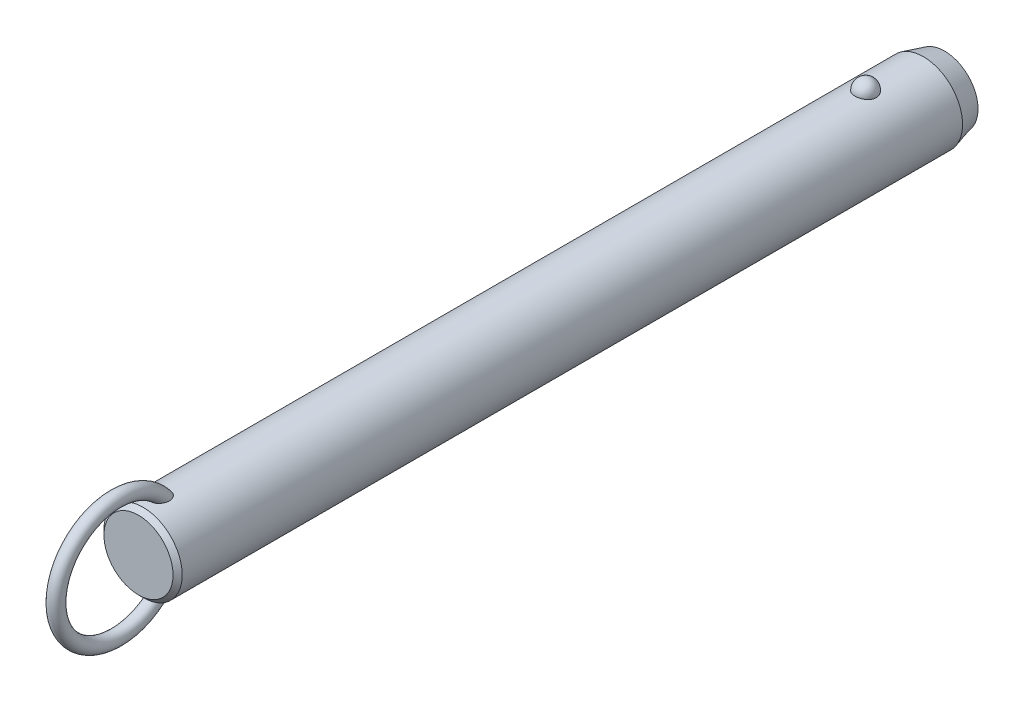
ISO-10303-21;
HEADER;
FILE_DESCRIPTION(('STEP AP214'),'2;1');
FILE_NAME('part.step','',(''),(''),'','','');
FILE_SCHEMA(('AUTOMOTIVE_DESIGN { 1 0 10303 214 1 1 1 1 }'));
ENDSEC;
DATA;
#1=APPLICATION_CONTEXT('core data for automotive mechanical design processes');
#2=APPLICATION_PROTOCOL_DEFINITION('international standard','automotive_design',2000,#1);
#3=PRODUCT_CONTEXT('',#1,'mechanical');
#4=PRODUCT('Part','Part','',(#3));
#5=PRODUCT_RELATED_PRODUCT_CATEGORY('part','',(#4));
#6=PRODUCT_DEFINITION_FORMATION('','',#4);
#7=PRODUCT_DEFINITION_CONTEXT('part definition',#1,'design');
#8=PRODUCT_DEFINITION('design','',#6,#7);
#9=PRODUCT_DEFINITION_SHAPE('','',#8);
#10=(LENGTH_UNIT() NAMED_UNIT(*) SI_UNIT(.MILLI.,.METRE.));
#11=(NAMED_UNIT(*) PLANE_ANGLE_UNIT() SI_UNIT($,.RADIAN.));
#12=(NAMED_UNIT(*) SI_UNIT($,.STERADIAN.) SOLID_ANGLE_UNIT());
#13=UNCERTAINTY_MEASURE_WITH_UNIT(LENGTH_MEASURE(1.E-05),#10,'distance_accuracy_value','');
#14=(GEOMETRIC_REPRESENTATION_CONTEXT(3) GLOBAL_UNCERTAINTY_ASSIGNED_CONTEXT((#13)) GLOBAL_UNIT_ASSIGNED_CONTEXT((#10,
#11,#12)) REPRESENTATION_CONTEXT('',''));
#15=CARTESIAN_POINT('',(0.,0.,0.));
#16=DIRECTION('',(0.,0.,1.));
#17=DIRECTION('',(1.,0.,0.));
#18=AXIS2_PLACEMENT_3D('',#15,#16,#17);
#19=CARTESIAN_POINT('',(0.,0.,190.5));
#20=DIRECTION('',(0.,0.,-1.));
#21=DIRECTION('',(-1.,0.,0.));
#22=AXIS2_PLACEMENT_3D('',#19,#20,#21);
#23=CYLINDRICAL_SURFACE('',#22,11.1);
#24=CARTESIAN_POINT('',(2.9724815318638,10.6945945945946,-3.00000000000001));
#25=CARTESIAN_POINT('',(2.97247830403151,10.6945972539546,-2.8322505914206));
#26=CARTESIAN_POINT('',(2.95876598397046,10.6984356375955,-2.66445972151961));
#27=CARTESIAN_POINT('',(2.90424529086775,10.7133624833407,-2.3336238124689));
#28=CARTESIAN_POINT('',(2.8634252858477,10.7244540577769,-2.17058084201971));
#29=CARTESIAN_POINT('',(2.75573657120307,10.7526272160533,-1.85396767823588));
#30=CARTESIAN_POINT('',(2.68887937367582,10.7697061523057,-1.70039333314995));
#31=CARTESIAN_POINT('',(2.53079696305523,10.8079438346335,-1.4069159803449));
#32=CARTESIAN_POINT('',(2.43957264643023,10.8291024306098,-1.26701246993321));
#33=CARTESIAN_POINT('',(2.23458150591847,10.8732541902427,-1.00409565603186));
#34=CARTESIAN_POINT('',(2.12071295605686,10.8962553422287,-0.881162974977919));
#35=CARTESIAN_POINT('',(1.87365402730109,10.9414421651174,-0.656352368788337));
#36=CARTESIAN_POINT('',(1.74046358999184,10.9636278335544,-0.554474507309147));
#37=CARTESIAN_POINT('',(1.45872188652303,11.0046495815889,-0.374872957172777));
#38=CARTESIAN_POINT('',(1.31021276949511,11.0234944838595,-0.297085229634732));
#39=CARTESIAN_POINT('',(1.00170030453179,11.0557957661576,-0.167529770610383));
#40=CARTESIAN_POINT('',(0.841698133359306,11.0692526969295,-0.1157593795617));
#41=CARTESIAN_POINT('',(0.517607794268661,11.0890932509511,-0.0403925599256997));
#42=CARTESIAN_POINT('',(0.353633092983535,11.0955916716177,-0.0163383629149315));
#43=CARTESIAN_POINT('',(0.0238420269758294,11.1011989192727,0.00445177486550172));
#44=CARTESIAN_POINT('',(-0.141974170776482,11.1003084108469,0.00119017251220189));
#45=CARTESIAN_POINT('',(-0.468405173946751,11.0912990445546,-0.0323233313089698));
#46=CARTESIAN_POINT('',(-0.629059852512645,11.0832767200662,-0.062214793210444));
#47=CARTESIAN_POINT('',(-0.942937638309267,11.0609962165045,-0.147645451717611));
#48=CARTESIAN_POINT('',(-1.09616062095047,11.0467379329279,-0.203185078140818));
#49=CARTESIAN_POINT('',(-1.39181061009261,11.0134071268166,-0.338752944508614));
#50=CARTESIAN_POINT('',(-1.53417383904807,10.9943086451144,-0.418913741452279));
#51=CARTESIAN_POINT('',(-1.80342160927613,10.9533667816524,-0.601448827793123));
#52=CARTESIAN_POINT('',(-1.9303046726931,10.9315231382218,-0.703825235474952));
#53=CARTESIAN_POINT('',(-2.16747598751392,10.887005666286,-0.930091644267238));
#54=CARTESIAN_POINT('',(-2.27742774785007,10.8643239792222,-1.05433291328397));
#55=CARTESIAN_POINT('',(-2.47517316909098,10.8209886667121,-1.31966633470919));
#56=CARTESIAN_POINT('',(-2.56296538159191,10.8003351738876,-1.46075958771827));
#57=CARTESIAN_POINT('',(-2.71500300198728,10.7631304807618,-1.75753646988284));
#58=CARTESIAN_POINT('',(-2.77898901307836,10.7466250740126,-1.91335887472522));
#59=CARTESIAN_POINT('',(-2.88046189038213,10.7198747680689,-2.23391529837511));
#60=CARTESIAN_POINT('',(-2.91794947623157,10.709629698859,-2.3986490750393));
#61=CARTESIAN_POINT('',(-2.96537819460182,10.6965949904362,-2.73165170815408));
#62=CARTESIAN_POINT('',(-2.97542891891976,10.693775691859,-2.89990378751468));
#63=CARTESIAN_POINT('',(-2.96804271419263,10.6958279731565,-3.23575286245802));
#64=CARTESIAN_POINT('',(-2.95060646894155,10.7006993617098,-3.4033498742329));
#65=CARTESIAN_POINT('',(-2.88883358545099,10.71753912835,-3.73233906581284));
#66=CARTESIAN_POINT('',(-2.84462026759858,10.7294749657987,-3.89375610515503));
#67=CARTESIAN_POINT('',(-2.73050447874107,10.7590797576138,-4.20667949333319));
#68=CARTESIAN_POINT('',(-2.66060103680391,10.7767489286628,-4.35818546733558));
#69=CARTESIAN_POINT('',(-2.49642559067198,10.8159599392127,-4.64785421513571));
#70=CARTESIAN_POINT('',(-2.40203047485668,10.8375211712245,-4.78594458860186));
#71=CARTESIAN_POINT('',(-2.19143488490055,10.8820570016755,-5.04410382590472));
#72=CARTESIAN_POINT('',(-2.07523364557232,10.9050316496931,-5.16417205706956));
#73=CARTESIAN_POINT('',(-1.82361254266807,10.9499219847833,-5.3833483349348));
#74=CARTESIAN_POINT('',(-1.68812945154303,10.9718338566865,-5.48238464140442));
#75=CARTESIAN_POINT('',(-1.40191298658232,11.0120611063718,-5.65618873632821));
#76=CARTESIAN_POINT('',(-1.25118062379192,11.0303767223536,-5.73095813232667));
#77=CARTESIAN_POINT('',(-0.940570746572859,11.0611653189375,-5.85334725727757));
#78=CARTESIAN_POINT('',(-0.780821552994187,11.0737044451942,-5.90127578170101));
#79=CARTESIAN_POINT('',(-0.455204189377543,11.0918598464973,-5.96992976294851));
#80=CARTESIAN_POINT('',(-0.289336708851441,11.0974768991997,-5.99065827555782));
#81=CARTESIAN_POINT('',(0.0406846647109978,11.1011307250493,-6.00418773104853));
#82=CARTESIAN_POINT('',(0.204817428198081,11.099299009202,-5.9974731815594));
#83=CARTESIAN_POINT('',(0.5295530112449,11.088551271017,-5.95740317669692));
#84=CARTESIAN_POINT('',(0.69015594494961,11.0796354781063,-5.92404858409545));
#85=CARTESIAN_POINT('',(1.0027760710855,11.0557204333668,-5.83180084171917));
#86=CARTESIAN_POINT('',(1.15482001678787,11.0407414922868,-5.7729929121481));
#87=CARTESIAN_POINT('',(1.44678373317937,11.0062913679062,-5.63147366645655));
#88=CARTESIAN_POINT('',(1.58670279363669,10.9868199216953,-5.54876095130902));
#89=CARTESIAN_POINT('',(1.8527023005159,10.9451315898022,-5.36027644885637));
#90=CARTESIAN_POINT('',(1.97855158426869,10.9228788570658,-5.25418644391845));
#91=CARTESIAN_POINT('',(2.21080872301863,10.8782509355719,-5.02251354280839));
#92=CARTESIAN_POINT('',(2.31721312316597,10.8558757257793,-4.89692718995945));
#93=CARTESIAN_POINT('',(2.5094551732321,10.8130715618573,-4.62745408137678));
#94=CARTESIAN_POINT('',(2.59493284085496,10.7926798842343,-4.48330448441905));
#95=CARTESIAN_POINT('',(2.740862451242,10.7565495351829,-4.18236358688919));
#96=CARTESIAN_POINT('',(2.80132490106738,10.7408089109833,-4.02557762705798));
#97=CARTESIAN_POINT('',(2.88959070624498,10.7173718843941,-3.72475308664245));
#98=CARTESIAN_POINT('',(2.92062102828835,10.7088950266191,-3.58171216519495));
#99=CARTESIAN_POINT('',(2.96206765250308,10.6975052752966,-3.29245795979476));
#100=CARTESIAN_POINT('',(2.97248434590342,10.6945922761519,-3.14624473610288));
#101=CARTESIAN_POINT('',(2.9724815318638,10.6945945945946,-3.00000000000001));
#102=B_SPLINE_CURVE_WITH_KNOTS('',3,(#24,#25,#26,#27,#28,#29,#30,#31,#32,#33,#34,#35,#36,#37,
#38,#39,#40,#41,#42,#43,#44,#45,#46,#47,#48,#49,#50,#51,#52,#53,#54,#55,#56,#57,#58,#59,#60,#61,
#62,#63,#64,#65,#66,#67,#68,#69,#70,#71,#72,#73,#74,#75,#76,#77,#78,#79,#80,#81,#82,#83,#84,#85,
#86,#87,#88,#89,#90,#91,#92,#93,#94,#95,#96,#97,#98,#99,#100,#101),.UNSPECIFIED.,.T.,.F.,(4,2,2,
2,2,2,2,2,2,2,2,2,2,2,2,2,2,2,2,2,2,2,2,2,2,2,2,2,2,2,2,2,2,2,2,2,2,2,4),(0.,0.502722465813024,
1.00566079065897,1.5083769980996,2.01107471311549,2.51608392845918,3.02109467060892,
3.52475118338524,4.02835620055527,4.523518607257,5.0186364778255,5.50715297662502,
5.9956776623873,6.48688002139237,6.97812923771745,7.47814366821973,7.9781907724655,
8.48353712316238,8.9888697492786,9.49218093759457,9.99547960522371,10.4964777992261,
10.997494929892,11.5010810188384,12.0046847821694,12.5099796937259,13.0152411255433,
13.5145635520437,14.0138298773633,14.5043200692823,14.9947943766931,15.4836390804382,
15.9725123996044,16.4685040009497,16.9645836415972,17.4686765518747,17.972557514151,
18.410841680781,18.849117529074),.UNSPECIFIED.);
#103=CARTESIAN_POINT('',(2.9724815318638,10.6945945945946,-3.00000000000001));
#104=VERTEX_POINT('',#103);
#105=EDGE_CURVE('E41',#104,#104,#102,.T.);
#106=ORIENTED_EDGE('',*,*,#105,.T.);
#107=EDGE_LOOP('',(#106));
#108=FACE_BOUND('',#107,.T.);
#109=CARTESIAN_POINT('',(0.,0.,201.9));
#110=DIRECTION('',(0.,0.,1.));
#111=DIRECTION('',(1.,0.,0.));
#112=AXIS2_PLACEMENT_3D('',#109,#110,#111);
#113=CIRCLE('',#112,11.1);
#114=CARTESIAN_POINT('',(11.1,0.,201.9));
#115=VERTEX_POINT('',#114);
#116=EDGE_CURVE('E10',#115,#115,#113,.F.);
#117=ORIENTED_EDGE('',*,*,#116,.T.);
#118=EDGE_LOOP('',(#117));
#119=FACE_BOUND('',#118,.T.);
#120=CARTESIAN_POINT('',(-0.564520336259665,-11.0856356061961,194.157815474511));
#121=CARTESIAN_POINT('',(-0.667202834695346,-11.0804062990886,194.191283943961));
#122=CARTESIAN_POINT('',(-0.766875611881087,-11.0738877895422,194.233835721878));
#123=CARTESIAN_POINT('',(-0.95728412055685,-11.0590576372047,194.335419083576));
#124=CARTESIAN_POINT('',(-1.04801616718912,-11.0507452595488,194.39445742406));
#125=CARTESIAN_POINT('',(-1.21800952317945,-11.0333016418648,194.526529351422));
#126=CARTESIAN_POINT('',(-1.2973080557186,-11.0241732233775,194.599515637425));
#127=CARTESIAN_POINT('',(-1.44337665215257,-11.0060026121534,194.757037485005));
#128=CARTESIAN_POINT('',(-1.51014622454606,-10.9969604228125,194.841573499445));
#129=CARTESIAN_POINT('',(-1.63454620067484,-10.9791841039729,195.025521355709));
#130=CARTESIAN_POINT('',(-1.69127003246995,-10.9705107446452,195.125549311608));
#131=CARTESIAN_POINT('',(-1.7898078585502,-10.9548648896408,195.332790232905));
#132=CARTESIAN_POINT('',(-1.83161214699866,-10.9478935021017,195.440007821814));
#133=CARTESIAN_POINT('',(-1.91557028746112,-10.9335803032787,195.705408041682));
#134=CARTESIAN_POINT('',(-1.95040620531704,-10.9273269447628,195.865980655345));
#135=CARTESIAN_POINT('',(-1.99388326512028,-10.9194709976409,196.190697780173));
#136=CARTESIAN_POINT('',(-2.00248051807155,-10.9178762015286,196.354847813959));
#137=CARTESIAN_POINT('',(-1.99551615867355,-10.9191578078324,196.724650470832));
#138=CARTESIAN_POINT('',(-1.97322066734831,-10.9232807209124,196.930191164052));
#139=CARTESIAN_POINT('',(-1.91529761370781,-10.9335244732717,197.233595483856));
#140=CARTESIAN_POINT('',(-1.89184575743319,-10.9376266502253,197.334088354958));
#141=CARTESIAN_POINT('',(-1.83700674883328,-10.9469720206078,197.532855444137));
#142=CARTESIAN_POINT('',(-1.80562070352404,-10.9522150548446,197.631129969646));
#143=CARTESIAN_POINT('',(-1.73463055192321,-10.9636837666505,197.825914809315));
#144=CARTESIAN_POINT('',(-1.69493416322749,-10.9699202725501,197.922390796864));
#145=CARTESIAN_POINT('',(-1.60745141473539,-10.9830806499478,198.111626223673));
#146=CARTESIAN_POINT('',(-1.55966150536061,-10.9900048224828,198.204384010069));
#147=CARTESIAN_POINT('',(-1.45591812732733,-11.0042280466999,198.384690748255));
#148=CARTESIAN_POINT('',(-1.40000013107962,-11.0115253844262,198.472260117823));
#149=CARTESIAN_POINT('',(-1.27937470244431,-11.0261911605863,198.641029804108));
#150=CARTESIAN_POINT('',(-1.21467835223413,-11.0335594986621,198.72223795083));
#151=CARTESIAN_POINT('',(-1.08218150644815,-11.0473027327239,198.869001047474));
#152=CARTESIAN_POINT('',(-1.01522633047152,-11.0537063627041,198.935309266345));
#153=CARTESIAN_POINT('',(-0.872952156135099,-11.065850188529,199.058378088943));
#154=CARTESIAN_POINT('',(-0.797642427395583,-11.0715911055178,199.115149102));
#155=CARTESIAN_POINT('',(-0.651396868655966,-11.081071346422,199.207515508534));
#156=CARTESIAN_POINT('',(-0.581712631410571,-11.0849841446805,199.245049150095));
#157=CARTESIAN_POINT('',(-0.437066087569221,-11.0916271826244,199.308259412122));
#158=CARTESIAN_POINT('',(-0.362109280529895,-11.0943586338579,199.333948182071));
#159=CARTESIAN_POINT('',(-0.207828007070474,-11.0983242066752,199.371117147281));
#160=CARTESIAN_POINT('',(-0.12846771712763,-11.0995432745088,199.382454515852));
#161=CARTESIAN_POINT('',(0.0309101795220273,-11.1002423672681,199.388965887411));
#162=CARTESIAN_POINT('',(0.110927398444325,-11.0997233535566,199.384148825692));
#163=CARTESIAN_POINT('',(0.25640659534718,-11.097240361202,199.360959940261));
#164=CARTESIAN_POINT('',(0.322235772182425,-11.0955074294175,199.344754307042));
#165=CARTESIAN_POINT('',(0.450635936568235,-11.0910350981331,199.302600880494));
#166=CARTESIAN_POINT('',(0.513205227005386,-11.0882951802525,199.276648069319));
#167=CARTESIAN_POINT('',(0.662626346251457,-11.0805620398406,199.202607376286));
#168=CARTESIAN_POINT('',(0.747127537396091,-11.0751144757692,199.149845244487));
#169=CARTESIAN_POINT('',(0.906756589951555,-11.0631932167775,199.031720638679));
#170=CARTESIAN_POINT('',(0.981859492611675,-11.0567168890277,198.966325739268));
#171=CARTESIAN_POINT('',(1.10712207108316,-11.0447856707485,198.84226337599));
#172=CARTESIAN_POINT('',(1.15909566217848,-11.0394280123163,198.785383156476));
#173=CARTESIAN_POINT('',(1.25791923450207,-11.0286040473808,198.667327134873));
#174=CARTESIAN_POINT('',(1.30476642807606,-11.0231376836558,198.606149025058));
#175=CARTESIAN_POINT('',(1.43818612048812,-11.0068027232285,198.417305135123));
#176=CARTESIAN_POINT('',(1.51751767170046,-10.9960104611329,198.284453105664));
#177=CARTESIAN_POINT('',(1.63597546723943,-10.9788847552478,198.053137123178));
#178=CARTESIAN_POINT('',(1.67988876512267,-10.9722190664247,197.957053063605));
#179=CARTESIAN_POINT('',(1.75953241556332,-10.9597298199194,197.761431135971));
#180=CARTESIAN_POINT('',(1.79525967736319,-10.9539065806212,197.661891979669));
#181=CARTESIAN_POINT('',(1.85844731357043,-10.9433632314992,197.46021118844));
#182=CARTESIAN_POINT('',(1.8859107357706,-10.9386427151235,197.35807052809));
#183=CARTESIAN_POINT('',(1.93234324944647,-10.9305350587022,197.151819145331));
#184=CARTESIAN_POINT('',(1.95131065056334,-10.9271481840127,197.047708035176));
#185=CARTESIAN_POINT('',(1.9904020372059,-10.9201183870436,196.765458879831));
#186=CARTESIAN_POINT('',(2.00221217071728,-10.9179256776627,196.586037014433));
#187=CARTESIAN_POINT('',(1.99711676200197,-10.9188636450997,196.227713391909));
#188=CARTESIAN_POINT('',(1.98026150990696,-10.9219849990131,196.048811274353));
#189=CARTESIAN_POINT('',(1.92151657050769,-10.9324473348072,195.73645144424));
#190=CARTESIAN_POINT('',(1.88605081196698,-10.9386915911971,195.601759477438));
#191=CARTESIAN_POINT('',(1.79393020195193,-10.9541780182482,195.339966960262));
#192=CARTESIAN_POINT('',(1.73729868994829,-10.9634168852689,195.212858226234));
#193=CARTESIAN_POINT('',(1.61237037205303,-10.9824218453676,194.989418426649));
#194=CARTESIAN_POINT('',(1.54715374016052,-10.9918945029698,194.891345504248));
#195=CARTESIAN_POINT('',(1.40127026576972,-11.0114415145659,194.707434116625));
#196=CARTESIAN_POINT('',(1.32060742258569,-11.0215157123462,194.621592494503));
#197=CARTESIAN_POINT('',(1.1447478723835,-11.041168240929,194.465163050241));
#198=CARTESIAN_POINT('',(1.04947805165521,-11.0507437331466,194.394656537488));
#199=CARTESIAN_POINT('',(0.847278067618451,-11.0680789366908,194.272640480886));
#200=CARTESIAN_POINT('',(0.740351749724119,-11.0758392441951,194.221124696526));
#201=CARTESIAN_POINT('',(0.529289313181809,-11.0878275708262,194.143485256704));
#202=CARTESIAN_POINT('',(0.425895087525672,-11.0923259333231,194.115377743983));
#203=CARTESIAN_POINT('',(0.215723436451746,-11.0984001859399,194.077703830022));
#204=CARTESIAN_POINT('',(0.10894793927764,-11.0999777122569,194.068127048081));
#205=CARTESIAN_POINT('',(-0.0938962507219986,-11.1000196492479,194.067877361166));
#206=CARTESIAN_POINT('',(-0.189967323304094,-11.0987797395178,194.075408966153));
#207=CARTESIAN_POINT('',(-0.379657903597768,-11.0939111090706,194.105507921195));
#208=CARTESIAN_POINT('',(-0.47327735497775,-11.0902823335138,194.128075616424));
#209=CARTESIAN_POINT('',(-0.564520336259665,-11.0856356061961,194.157815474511));
#210=B_SPLINE_CURVE_WITH_KNOTS('',3,(#120,#121,#122,#123,#124,#125,#126,#127,#128,#129,#130,
#131,#132,#133,#134,#135,#136,#137,#138,#139,#140,#141,#142,#143,#144,#145,#146,#147,#148,#149,
#150,#151,#152,#153,#154,#155,#156,#157,#158,#159,#160,#161,#162,#163,#164,#165,#166,#167,#168,
#169,#170,#171,#172,#173,#174,#175,#176,#177,#178,#179,#180,#181,#182,#183,#184,#185,#186,#187,
#188,#189,#190,#191,#192,#193,#194,#195,#196,#197,#198,#199,#200,#201,#202,#203,#204,#205,#206,
#207,#208,#209),.UNSPECIFIED.,.T.,.F.,(4,2,2,2,2,2,2,2,2,2,2,2,2,2,2,2,2,2,2,2,2,2,2,2,2,2,2,2,
2,2,2,2,2,2,2,2,2,2,2,2,2,2,2,2,4),(0.,0.323999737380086,0.64813245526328,0.971184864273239,
1.29424994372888,1.63886237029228,1.98369857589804,2.47426059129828,2.96564271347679,
3.58257396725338,3.89215258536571,4.20168803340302,4.51486273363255,4.82817514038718,
5.14015911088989,5.45175282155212,5.73442856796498,6.01679375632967,6.2536458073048,
6.49025437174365,6.72919963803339,6.96801276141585,7.17061258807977,7.37331685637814,
7.67094989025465,7.96935728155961,8.20075067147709,8.4322692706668,8.89581623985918,
9.21306533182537,9.5304340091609,9.84768549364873,10.1650000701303,10.7022930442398,
11.2386443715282,11.655339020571,12.071575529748,12.4245637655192,12.7774607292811,
13.1321855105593,13.4867936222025,13.8068771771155,14.1267813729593,14.4146787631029,
14.7025827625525),.UNSPECIFIED.);
#211=CARTESIAN_POINT('',(-0.564520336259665,-11.0856356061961,194.157815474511));
#212=VERTEX_POINT('',#211);
#213=EDGE_CURVE('E60',#212,#212,#210,.T.);
#214=ORIENTED_EDGE('',*,*,#213,.T.);
#215=EDGE_LOOP('',(#214));
#216=FACE_BOUND('',#215,.T.);
#217=CARTESIAN_POINT('',(-0.564520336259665,11.0856356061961,194.157815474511));
#218=CARTESIAN_POINT('',(-0.468542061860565,11.0905203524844,194.126545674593));
#219=CARTESIAN_POINT('',(-0.369793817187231,11.0942886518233,194.103157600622));
#220=CARTESIAN_POINT('',(-0.169555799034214,11.0991586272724,194.073085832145));
#221=CARTESIAN_POINT('',(-0.0680604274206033,11.1002543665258,194.06643932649));
#222=CARTESIAN_POINT('',(0.134549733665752,11.099646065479,194.070157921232));
#223=CARTESIAN_POINT('',(0.235664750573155,11.0979441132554,194.08051033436));
#224=CARTESIAN_POINT('',(0.434632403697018,11.0919342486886,194.117831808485));
#225=CARTESIAN_POINT('',(0.532486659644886,11.0876276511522,194.144792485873));
#226=CARTESIAN_POINT('',(0.722445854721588,11.0768742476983,194.2144096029));
#227=CARTESIAN_POINT('',(0.814543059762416,11.0704246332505,194.257086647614));
#228=CARTESIAN_POINT('',(0.990565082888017,11.0560659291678,194.356648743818));
#229=CARTESIAN_POINT('',(1.07448844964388,11.048156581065,194.413536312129));
#230=CARTESIAN_POINT('',(1.23562672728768,11.0313221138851,194.542210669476));
#231=CARTESIAN_POINT('',(1.31242684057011,11.0223686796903,194.614511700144));
#232=CARTESIAN_POINT('',(1.45398030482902,11.0045918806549,194.770042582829));
#233=CARTESIAN_POINT('',(1.51873073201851,10.9957685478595,194.853275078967));
#234=CARTESIAN_POINT('',(1.64107232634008,10.9782087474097,195.036384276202));
#235=CARTESIAN_POINT('',(1.6974317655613,10.9695572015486,195.137089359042));
#236=CARTESIAN_POINT('',(1.79515063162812,10.9539887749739,195.345626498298));
#237=CARTESIAN_POINT('',(1.83649966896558,10.9470730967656,195.45346343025));
#238=CARTESIAN_POINT('',(1.91931148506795,10.9329211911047,195.720399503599));
#239=CARTESIAN_POINT('',(1.95340104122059,10.9267904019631,195.881861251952));
#240=CARTESIAN_POINT('',(1.99526195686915,10.9192174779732,196.20821631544));
#241=CARTESIAN_POINT('',(2.00298989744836,10.9177830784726,196.37311484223));
#242=CARTESIAN_POINT('',(1.99396251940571,10.9194420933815,196.744100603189));
#243=CARTESIAN_POINT('',(1.97050829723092,10.923774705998,196.95003871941));
#244=CARTESIAN_POINT('',(1.91079643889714,10.9343131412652,197.253901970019));
#245=CARTESIAN_POINT('',(1.88673702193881,10.9385106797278,197.354529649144));
#246=CARTESIAN_POINT('',(1.8306550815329,10.9480376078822,197.553510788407));
#247=CARTESIAN_POINT('',(1.79863369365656,10.9533668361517,197.651864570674));
#248=CARTESIAN_POINT('',(1.72633365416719,10.9649954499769,197.846720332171));
#249=CARTESIAN_POINT('',(1.68596409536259,10.9713053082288,197.94318790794));
#250=CARTESIAN_POINT('',(1.59707998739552,10.9845964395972,198.132323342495));
#251=CARTESIAN_POINT('',(1.54856169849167,10.9915780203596,198.224989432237));
#252=CARTESIAN_POINT('',(1.44330168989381,11.0058935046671,198.404975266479));
#253=CARTESIAN_POINT('',(1.3865974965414,11.0132257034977,198.492316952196));
#254=CARTESIAN_POINT('',(1.26431158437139,11.0279330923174,198.660456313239));
#255=CARTESIAN_POINT('',(1.19874160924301,11.0353082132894,198.741262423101));
#256=CARTESIAN_POINT('',(1.06542088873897,11.048931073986,198.885985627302));
#257=CARTESIAN_POINT('',(0.998640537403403,11.0552153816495,198.950784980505));
#258=CARTESIAN_POINT('',(0.856896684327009,11.0671032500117,199.070846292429));
#259=CARTESIAN_POINT('',(0.781942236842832,11.0727075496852,199.126118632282));
#260=CARTESIAN_POINT('',(0.636276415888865,11.081949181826,199.215972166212));
#261=CARTESIAN_POINT('',(0.566755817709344,11.0857572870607,199.252441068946));
#262=CARTESIAN_POINT('',(0.422602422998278,11.0921860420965,199.313533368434));
#263=CARTESIAN_POINT('',(0.347974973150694,11.0948079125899,199.338168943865));
#264=CARTESIAN_POINT('',(0.194593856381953,11.0985608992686,199.373323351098));
#265=CARTESIAN_POINT('',(0.115807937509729,11.0996777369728,199.383706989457));
#266=CARTESIAN_POINT('',(-0.0422499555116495,11.1002003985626,199.388574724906));
#267=CARTESIAN_POINT('',(-0.121521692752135,11.09960699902,199.383066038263));
#268=CARTESIAN_POINT('',(-0.266046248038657,11.0970123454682,199.358827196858));
#269=CARTESIAN_POINT('',(-0.331661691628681,11.0952283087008,199.342135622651));
#270=CARTESIAN_POINT('',(-0.459588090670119,11.0906663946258,199.299111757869));
#271=CARTESIAN_POINT('',(-0.52189737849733,11.0878880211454,199.272774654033));
#272=CARTESIAN_POINT('',(-0.671446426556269,11.0800342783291,199.197513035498));
#273=CARTESIAN_POINT('',(-0.756250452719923,11.0744969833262,199.143818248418));
#274=CARTESIAN_POINT('',(-0.916349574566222,11.0624045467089,199.023802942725));
#275=CARTESIAN_POINT('',(-0.991618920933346,11.0558467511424,198.957449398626));
#276=CARTESIAN_POINT('',(-1.11713140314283,11.0437783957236,198.831633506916));
#277=CARTESIAN_POINT('',(-1.16920539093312,11.0383619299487,198.773952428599));
#278=CARTESIAN_POINT('',(-1.26817476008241,11.02743010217,198.654280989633));
#279=CARTESIAN_POINT('',(-1.31506731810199,11.0219146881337,198.592288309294));
#280=CARTESIAN_POINT('',(-1.40399813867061,11.0109399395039,198.464784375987));
#281=CARTESIAN_POINT('',(-1.44602864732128,11.0054807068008,198.399267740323));
#282=CARTESIAN_POINT('',(-1.52538779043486,10.9947621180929,198.265422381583));
#283=CARTESIAN_POINT('',(-1.56271516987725,10.9895028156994,198.197092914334));
#284=CARTESIAN_POINT('',(-1.64537943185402,10.9774790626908,198.033210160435));
#285=CARTESIAN_POINT('',(-1.68879497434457,10.9708503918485,197.9366735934));
#286=CARTESIAN_POINT('',(-1.76740738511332,10.9584602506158,197.740236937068));
#287=CARTESIAN_POINT('',(-1.80260120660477,10.95269910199,197.64033561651));
#288=CARTESIAN_POINT('',(-1.86468657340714,10.9423003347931,197.437966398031));
#289=CARTESIAN_POINT('',(-1.8915816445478,10.9376622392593,197.335499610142));
#290=CARTESIAN_POINT('',(-1.93682458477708,10.9297405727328,197.128642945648));
#291=CARTESIAN_POINT('',(-1.95517082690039,10.9264572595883,197.024252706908));
#292=CARTESIAN_POINT('',(-1.99232562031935,10.9197647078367,196.74262876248));
#293=CARTESIAN_POINT('',(-2.00294603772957,10.9177914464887,196.564185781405));
#294=CARTESIAN_POINT('',(-1.99566675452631,10.9191290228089,196.207996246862));
#295=CARTESIAN_POINT('',(-1.97781651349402,10.9224306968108,196.03024902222));
#296=CARTESIAN_POINT('',(-1.91747214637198,10.9331592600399,195.719792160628));
#297=CARTESIAN_POINT('',(-1.88131022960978,10.9395108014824,195.585825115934));
#298=CARTESIAN_POINT('',(-1.78790380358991,10.9551659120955,195.32559757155));
#299=CARTESIAN_POINT('',(-1.73068309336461,10.9644661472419,195.199328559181));
#300=CARTESIAN_POINT('',(-1.60475573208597,10.9835398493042,194.97741565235));
#301=CARTESIAN_POINT('',(-1.53908879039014,10.9930297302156,194.880026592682));
#302=CARTESIAN_POINT('',(-1.39238608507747,11.0125708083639,194.697525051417));
#303=CARTESIAN_POINT('',(-1.31135150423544,11.0226219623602,194.612411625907));
#304=CARTESIAN_POINT('',(-1.14382035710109,11.0411991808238,194.46529943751));
#305=CARTESIAN_POINT('',(-1.0585850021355,11.0497792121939,194.40186930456));
#306=CARTESIAN_POINT('',(-0.878723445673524,11.0655285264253,194.290250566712));
#307=CARTESIAN_POINT('',(-0.784123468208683,11.0727015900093,194.242020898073));
#308=CARTESIAN_POINT('',(-0.646163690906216,11.0812501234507,194.186023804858));
#309=CARTESIAN_POINT('',(-0.605595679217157,11.0835451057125,194.171197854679));
#310=CARTESIAN_POINT('',(-0.564520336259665,11.0856356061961,194.157815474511));
#311=B_SPLINE_CURVE_WITH_KNOTS('',3,(#217,#218,#219,#220,#221,#222,#223,#224,#225,#226,#227,
#228,#229,#230,#231,#232,#233,#234,#235,#236,#237,#238,#239,#240,#241,#242,#243,#244,#245,#246,
#247,#248,#249,#250,#251,#252,#253,#254,#255,#256,#257,#258,#259,#260,#261,#262,#263,#264,#265,
#266,#267,#268,#269,#270,#271,#272,#273,#274,#275,#276,#277,#278,#279,#280,#281,#282,#283,#284,
#285,#286,#287,#288,#289,#290,#291,#292,#293,#294,#295,#296,#297,#298,#299,#300,#301,#302,#303,
#304,#305,#306,#307,#308,#309,#310),.UNSPECIFIED.,.T.,.F.,(4,2,2,2,2,2,2,2,2,2,2,2,2,2,2,2,2,2,
2,2,2,2,2,2,2,2,2,2,2,2,2,2,2,2,2,2,2,2,2,2,2,2,2,2,2,2,4),(0.,0.303061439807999,
0.606795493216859,0.910302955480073,1.21365733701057,1.51741085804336,1.82121821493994,
2.1374520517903,2.45376252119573,2.79958678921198,3.14564996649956,3.63832391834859,
4.13180893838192,4.75031912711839,5.06071926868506,5.37107516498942,5.6850077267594,
5.99908475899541,6.31176519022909,6.62403542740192,6.90315673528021,7.18197194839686,
7.41687778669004,7.65154134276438,7.88841587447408,8.12518286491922,8.32752842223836,
8.52997509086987,8.82986421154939,9.13054668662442,9.36393502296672,9.59744991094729,
9.83133221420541,10.0652767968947,10.383032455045,10.7009056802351,11.0186436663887,
11.3364420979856,11.8705925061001,12.4038159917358,12.8189662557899,13.2336487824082,
13.5857049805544,13.9377340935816,14.2561354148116,14.5736690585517,14.7033687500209),.UNSPECIFIED.);
#312=CARTESIAN_POINT('',(-0.564520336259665,11.0856356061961,194.157815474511));
#313=VERTEX_POINT('',#312);
#314=EDGE_CURVE('E67',#313,#313,#311,.T.);
#315=ORIENTED_EDGE('',*,*,#314,.T.);
#316=EDGE_LOOP('',(#315));
#317=FACE_BOUND('',#316,.T.);
#318=CARTESIAN_POINT('',(0.,0.,-19.3999999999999));
#319=DIRECTION('',(0.,0.,-1.));
#320=DIRECTION('',(-1.,0.,0.));
#321=AXIS2_PLACEMENT_3D('',#318,#319,#320);
#322=CIRCLE('',#321,11.1);
#323=CARTESIAN_POINT('',(-11.1,0.,-19.3999999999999));
#324=VERTEX_POINT('',#323);
#325=EDGE_CURVE('E57',#324,#324,#322,.F.);
#326=ORIENTED_EDGE('',*,*,#325,.T.);
#327=EDGE_LOOP('',(#326));
#328=FACE_BOUND('',#327,.T.);
#329=ADVANCED_FACE('F37',(#108,#119,#216,#317,#328),#23,.T.);
#330=CARTESIAN_POINT('',(0.,0.,-25.4));
#331=DIRECTION('',(0.,0.,-1.));
#332=DIRECTION('',(-1.,0.,0.));
#333=AXIS2_PLACEMENT_3D('',#330,#331,#332);
#334=PLANE('',#333);
#335=CARTESIAN_POINT('',(0.,0.,-25.4));
#336=DIRECTION('',(0.,0.,-1.));
#337=DIRECTION('',(-1.,0.,0.));
#338=AXIS2_PLACEMENT_3D('',#335,#336,#337);
#339=CIRCLE('',#338,9.49230484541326);
#340=CARTESIAN_POINT('',(-9.49230484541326,0.,-25.4));
#341=VERTEX_POINT('',#340);
#342=EDGE_CURVE('E66',#341,#341,#339,.T.);
#343=ORIENTED_EDGE('',*,*,#342,.T.);
#344=EDGE_LOOP('',(#343));
#345=FACE_BOUND('',#344,.T.);
#346=ADVANCED_FACE('F85',(#345),#334,.T.);
#347=CARTESIAN_POINT('',(0.,0.,-25.4));
#348=DIRECTION('',(0.,0.,1.));
#349=DIRECTION('',(1.,0.,0.));
#350=AXIS2_PLACEMENT_3D('',#347,#348,#349);
#351=CONICAL_SURFACE('',#350,9.49230484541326,0.261799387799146);
#352=ORIENTED_EDGE('',*,*,#325,.F.);
#353=EDGE_LOOP('',(#352));
#354=FACE_BOUND('',#353,.T.);
#355=ORIENTED_EDGE('',*,*,#342,.F.);
#356=EDGE_LOOP('',(#355));
#357=FACE_BOUND('',#356,.T.);
#358=ADVANCED_FACE('F83',(#354,#357),#351,.T.);
#359=CARTESIAN_POINT('',(0.,0.,203.2));
#360=DIRECTION('',(0.,0.,1.));
#361=DIRECTION('',(1.,0.,0.));
#362=AXIS2_PLACEMENT_3D('',#359,#360,#361);
#363=PLANE('',#362);
#364=CARTESIAN_POINT('',(0.,0.,203.2));
#365=DIRECTION('',(0.,0.,1.));
#366=DIRECTION('',(1.,0.,0.));
#367=AXIS2_PLACEMENT_3D('',#364,#365,#366);
#368=CIRCLE('',#367,9.80000000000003);
#369=CARTESIAN_POINT('',(9.80000000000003,0.,203.2));
#370=VERTEX_POINT('',#369);
#371=EDGE_CURVE('E50',#370,#370,#368,.T.);
#372=ORIENTED_EDGE('',*,*,#371,.T.);
#373=EDGE_LOOP('',(#372));
#374=FACE_BOUND('',#373,.T.);
#375=ADVANCED_FACE('F77',(#374),#363,.T.);
#376=CARTESIAN_POINT('',(0.,0.,209.55));
#377=DIRECTION('',(1.,0.,0.));
#378=DIRECTION('',(0.,0.,-1.));
#379=AXIS2_PLACEMENT_3D('',#376,#377,#378);
#380=TOROIDAL_SURFACE('',#379,17.05,2.);
#381=ORIENTED_EDGE('',*,*,#314,.F.);
#382=EDGE_LOOP('',(#381));
#383=FACE_BOUND('',#382,.T.);
#384=ORIENTED_EDGE('',*,*,#213,.F.);
#385=EDGE_LOOP('',(#384));
#386=FACE_BOUND('',#385,.T.);
#387=ADVANCED_FACE('F73',(#383,#386),#380,.T.);
#388=CARTESIAN_POINT('',(0.,0.,203.2));
#389=DIRECTION('',(0.,0.,-1.));
#390=DIRECTION('',(-1.,0.,0.));
#391=AXIS2_PLACEMENT_3D('',#388,#389,#390);
#392=CONICAL_SURFACE('',#391,9.80000000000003,0.785398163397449);
#393=ORIENTED_EDGE('',*,*,#116,.F.);
#394=EDGE_LOOP('',(#393));
#395=FACE_BOUND('',#394,.T.);
#396=ORIENTED_EDGE('',*,*,#371,.F.);
#397=EDGE_LOOP('',(#396));
#398=FACE_BOUND('',#397,.T.);
#399=ADVANCED_FACE('F39',(#395,#398),#392,.T.);
#400=CARTESIAN_POINT('',(0.,11.1,-3.00000000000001));
#401=DIRECTION('',(0.,1.,0.));
#402=DIRECTION('',(0.,0.,-1.));
#403=AXIS2_PLACEMENT_3D('',#400,#401,#402);
#404=SPHERICAL_SURFACE('',#403,3.);
#405=ORIENTED_EDGE('',*,*,#105,.F.);
#406=EDGE_LOOP('',(#405));
#407=FACE_BOUND('',#406,.T.);
#408=ADVANCED_FACE('F79',(#407),#404,.T.);
#409=CLOSED_SHELL('',(#329,#346,#358,#375,#387,#399,#408));
#410=MANIFOLD_SOLID_BREP('B2',#409);
#411=ADVANCED_BREP_SHAPE_REPRESENTATION('',(#18,#410),#14);
#412=SHAPE_DEFINITION_REPRESENTATION(#9,#411);
ENDSEC;
END-ISO-10303-21;
